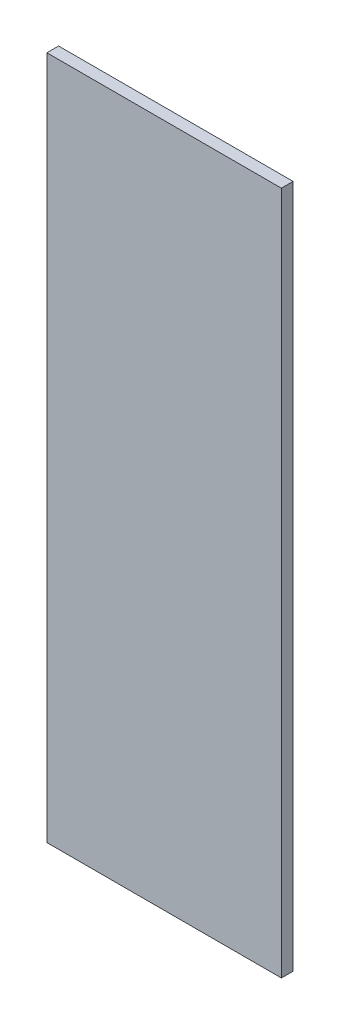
ISO-10303-21;
HEADER;
FILE_DESCRIPTION(('STEP AP214'),'2;1');
FILE_NAME('part.step','',(''),(''),'','','');
FILE_SCHEMA(('AUTOMOTIVE_DESIGN { 1 0 10303 214 1 1 1 1 }'));
ENDSEC;
DATA;
#1=APPLICATION_CONTEXT('core data for automotive mechanical design processes');
#2=APPLICATION_PROTOCOL_DEFINITION('international standard','automotive_design',2000,#1);
#3=PRODUCT_CONTEXT('',#1,'mechanical');
#4=PRODUCT('Part','Part','',(#3));
#5=PRODUCT_RELATED_PRODUCT_CATEGORY('part','',(#4));
#6=PRODUCT_DEFINITION_FORMATION('','',#4);
#7=PRODUCT_DEFINITION_CONTEXT('part definition',#1,'design');
#8=PRODUCT_DEFINITION('design','',#6,#7);
#9=PRODUCT_DEFINITION_SHAPE('','',#8);
#10=(LENGTH_UNIT() NAMED_UNIT(*) SI_UNIT(.MILLI.,.METRE.));
#11=(NAMED_UNIT(*) PLANE_ANGLE_UNIT() SI_UNIT($,.RADIAN.));
#12=(NAMED_UNIT(*) SI_UNIT($,.STERADIAN.) SOLID_ANGLE_UNIT());
#13=UNCERTAINTY_MEASURE_WITH_UNIT(LENGTH_MEASURE(1.E-05),#10,'distance_accuracy_value','');
#14=(GEOMETRIC_REPRESENTATION_CONTEXT(3) GLOBAL_UNCERTAINTY_ASSIGNED_CONTEXT((#13)) GLOBAL_UNIT_ASSIGNED_CONTEXT((#10,
#11,#12)) REPRESENTATION_CONTEXT('',''));
#15=CARTESIAN_POINT('',(0.,0.,0.));
#16=DIRECTION('',(0.,0.,1.));
#17=DIRECTION('',(1.,0.,0.));
#18=AXIS2_PLACEMENT_3D('',#15,#16,#17);
#19=CARTESIAN_POINT('',(30.,87.5,3.));
#20=DIRECTION('',(-1.,0.,0.));
#21=DIRECTION('',(0.,-1.,0.));
#22=AXIS2_PLACEMENT_3D('',#19,#20,#21);
#23=PLANE('',#22);
#24=DIRECTION('',(0.,1.,0.));
#25=VECTOR('',#24,1.);
#26=CARTESIAN_POINT('',(30.,87.5,0.));
#27=LINE('',#26,#25);
#28=CARTESIAN_POINT('',(30.,-87.5,0.));
#29=VERTEX_POINT('',#28);
#30=CARTESIAN_POINT('',(30.,87.5,0.));
#31=VERTEX_POINT('',#30);
#32=EDGE_CURVE('E97',#29,#31,#27,.T.);
#33=ORIENTED_EDGE('',*,*,#32,.T.);
#34=DIRECTION('',(0.,0.,-1.));
#35=VECTOR('',#34,1.);
#36=CARTESIAN_POINT('',(30.,87.5,3.));
#37=LINE('',#36,#35);
#38=CARTESIAN_POINT('',(30.,87.5,3.));
#39=VERTEX_POINT('',#38);
#40=EDGE_CURVE('E11',#39,#31,#37,.T.);
#41=ORIENTED_EDGE('',*,*,#40,.F.);
#42=DIRECTION('',(0.,1.,0.));
#43=VECTOR('',#42,1.);
#44=CARTESIAN_POINT('',(30.,87.5,3.));
#45=LINE('',#44,#43);
#46=CARTESIAN_POINT('',(30.,-87.5,3.));
#47=VERTEX_POINT('',#46);
#48=EDGE_CURVE('E85',#47,#39,#45,.T.);
#49=ORIENTED_EDGE('',*,*,#48,.F.);
#50=DIRECTION('',(0.,0.,-1.));
#51=VECTOR('',#50,1.);
#52=CARTESIAN_POINT('',(30.,-87.5,3.));
#53=LINE('',#52,#51);
#54=EDGE_CURVE('E93',#47,#29,#53,.T.);
#55=ORIENTED_EDGE('',*,*,#54,.T.);
#56=EDGE_LOOP('',(#33,#41,#49,#55));
#57=FACE_BOUND('',#56,.T.);
#58=ADVANCED_FACE('F34',(#57),#23,.F.);
#59=CARTESIAN_POINT('',(-30.,87.5,3.));
#60=DIRECTION('',(0.,-1.,0.));
#61=DIRECTION('',(0.,0.,-1.));
#62=AXIS2_PLACEMENT_3D('',#59,#60,#61);
#63=PLANE('',#62);
#64=DIRECTION('',(-1.,0.,0.));
#65=VECTOR('',#64,1.);
#66=CARTESIAN_POINT('',(-30.,87.5,0.));
#67=LINE('',#66,#65);
#68=CARTESIAN_POINT('',(-30.,87.5,0.));
#69=VERTEX_POINT('',#68);
#70=EDGE_CURVE('E89',#31,#69,#67,.T.);
#71=ORIENTED_EDGE('',*,*,#70,.T.);
#72=DIRECTION('',(0.,0.,-1.));
#73=VECTOR('',#72,1.);
#74=CARTESIAN_POINT('',(-30.,87.5,3.));
#75=LINE('',#74,#73);
#76=CARTESIAN_POINT('',(-30.,87.5,3.));
#77=VERTEX_POINT('',#76);
#78=EDGE_CURVE('E42',#77,#69,#75,.T.);
#79=ORIENTED_EDGE('',*,*,#78,.F.);
#80=DIRECTION('',(-1.,0.,0.));
#81=VECTOR('',#80,1.);
#82=CARTESIAN_POINT('',(-30.,87.5,3.));
#83=LINE('',#82,#81);
#84=EDGE_CURVE('E80',#39,#77,#83,.T.);
#85=ORIENTED_EDGE('',*,*,#84,.F.);
#86=ORIENTED_EDGE('',*,*,#40,.T.);
#87=EDGE_LOOP('',(#71,#79,#85,#86));
#88=FACE_BOUND('',#87,.T.);
#89=ADVANCED_FACE('F88',(#88),#63,.F.);
#90=CARTESIAN_POINT('',(-30.,87.5,3.));
#91=DIRECTION('',(1.,0.,0.));
#92=DIRECTION('',(0.,1.,0.));
#93=AXIS2_PLACEMENT_3D('',#90,#91,#92);
#94=PLANE('',#93);
#95=DIRECTION('',(0.,-1.,0.));
#96=VECTOR('',#95,1.);
#97=CARTESIAN_POINT('',(-30.,87.5,0.));
#98=LINE('',#97,#96);
#99=CARTESIAN_POINT('',(-30.,-87.5,0.));
#100=VERTEX_POINT('',#99);
#101=EDGE_CURVE('E67',#69,#100,#98,.T.);
#102=ORIENTED_EDGE('',*,*,#101,.T.);
#103=DIRECTION('',(0.,0.,-1.));
#104=VECTOR('',#103,1.);
#105=CARTESIAN_POINT('',(-30.,-87.5,3.));
#106=LINE('',#105,#104);
#107=CARTESIAN_POINT('',(-30.,-87.5,3.));
#108=VERTEX_POINT('',#107);
#109=EDGE_CURVE('E90',#108,#100,#106,.T.);
#110=ORIENTED_EDGE('',*,*,#109,.F.);
#111=DIRECTION('',(0.,-1.,0.));
#112=VECTOR('',#111,1.);
#113=CARTESIAN_POINT('',(-30.,87.5,3.));
#114=LINE('',#113,#112);
#115=EDGE_CURVE('E83',#77,#108,#114,.T.);
#116=ORIENTED_EDGE('',*,*,#115,.F.);
#117=ORIENTED_EDGE('',*,*,#78,.T.);
#118=EDGE_LOOP('',(#102,#110,#116,#117));
#119=FACE_BOUND('',#118,.T.);
#120=ADVANCED_FACE('F91',(#119),#94,.F.);
#121=CARTESIAN_POINT('',(-30.,-87.5,3.));
#122=DIRECTION('',(0.,1.,0.));
#123=DIRECTION('',(0.,0.,1.));
#124=AXIS2_PLACEMENT_3D('',#121,#122,#123);
#125=PLANE('',#124);
#126=DIRECTION('',(1.,0.,0.));
#127=VECTOR('',#126,1.);
#128=CARTESIAN_POINT('',(-30.,-87.5,0.));
#129=LINE('',#128,#127);
#130=EDGE_CURVE('E73',#100,#29,#129,.T.);
#131=ORIENTED_EDGE('',*,*,#130,.T.);
#132=ORIENTED_EDGE('',*,*,#54,.F.);
#133=DIRECTION('',(1.,0.,0.));
#134=VECTOR('',#133,1.);
#135=CARTESIAN_POINT('',(-30.,-87.5,3.));
#136=LINE('',#135,#134);
#137=EDGE_CURVE('E50',#108,#47,#136,.T.);
#138=ORIENTED_EDGE('',*,*,#137,.F.);
#139=ORIENTED_EDGE('',*,*,#109,.T.);
#140=EDGE_LOOP('',(#131,#132,#138,#139));
#141=FACE_BOUND('',#140,.T.);
#142=ADVANCED_FACE('F104',(#141),#125,.F.);
#143=CARTESIAN_POINT('',(0.,0.,3.));
#144=DIRECTION('',(0.,0.,1.));
#145=DIRECTION('',(1.,0.,0.));
#146=AXIS2_PLACEMENT_3D('',#143,#144,#145);
#147=PLANE('',#146);
#148=ORIENTED_EDGE('',*,*,#48,.T.);
#149=ORIENTED_EDGE('',*,*,#84,.T.);
#150=ORIENTED_EDGE('',*,*,#115,.T.);
#151=ORIENTED_EDGE('',*,*,#137,.T.);
#152=EDGE_LOOP('',(#148,#149,#150,#151));
#153=FACE_BOUND('',#152,.T.);
#154=ADVANCED_FACE('F81',(#153),#147,.T.);
#155=CARTESIAN_POINT('',(0.,0.,0.));
#156=DIRECTION('',(0.,0.,1.));
#157=DIRECTION('',(1.,0.,0.));
#158=AXIS2_PLACEMENT_3D('',#155,#156,#157);
#159=PLANE('',#158);
#160=ORIENTED_EDGE('',*,*,#32,.F.);
#161=ORIENTED_EDGE('',*,*,#130,.F.);
#162=ORIENTED_EDGE('',*,*,#101,.F.);
#163=ORIENTED_EDGE('',*,*,#70,.F.);
#164=EDGE_LOOP('',(#160,#161,#162,#163));
#165=FACE_BOUND('',#164,.T.);
#166=ADVANCED_FACE('F107',(#165),#159,.F.);
#167=CLOSED_SHELL('',(#58,#89,#120,#142,#154,#166));
#168=MANIFOLD_SOLID_BREP('B2',#167);
#169=ADVANCED_BREP_SHAPE_REPRESENTATION('',(#18,#168),#14);
#170=SHAPE_DEFINITION_REPRESENTATION(#9,#169);
ENDSEC;
END-ISO-10303-21;
